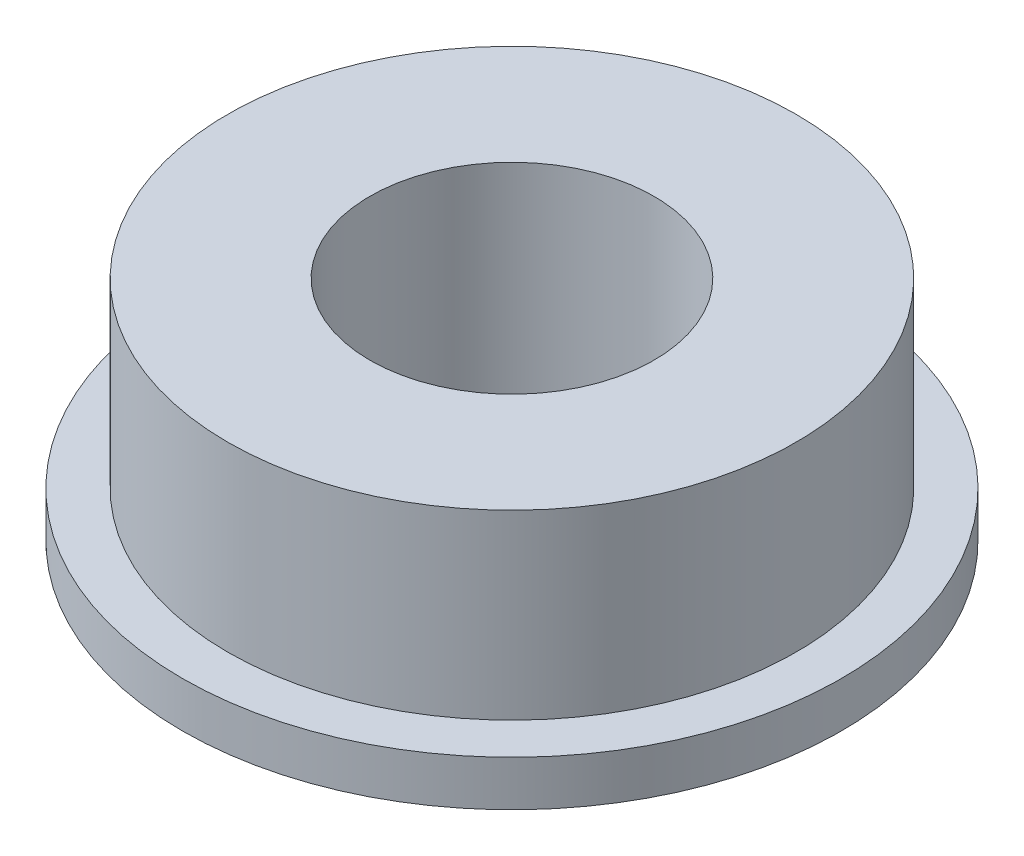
from build123d import *

# Parameters (mm, degrees)
SKETCH_1_R      = 5.8
SKETCH_1_R_2    = 2.5
EXTRUDE_1_DEPTH = 0.8
EXTRUDE_START   = -0.8
SKETCH_2_R      = 5
SKETCH_2_R_2    = 2.5
EXTRUDE_2_DEPTH = 4


with BuildPart() as part:
    # Sketch 1 → Extrude 1 (new body)
    with BuildSketch(Plane(origin=(0, 0, 0), x_dir=(1, 0, 0), z_dir=(0, 1, 0))):
        with Locations(Location((0, 0, 0), (0, 0, 270))):
            Circle(SKETCH_1_R)
        with Locations(Location((0, 0, 0), (0, 0, 270))):
            Circle(SKETCH_1_R_2, mode=Mode.SUBTRACT)
    extrude(amount=EXTRUDE_1_DEPTH)

    # Sketch 2 → Extrude 2 (add)
    with BuildSketch(Plane(origin=(0, 0.8, 0), x_dir=(1, 0, 0), z_dir=(0, 1, 0)).offset(EXTRUDE_START)):
        with Locations(Location((0, 0, 0), (0, 0, 270))):
            Circle(SKETCH_2_R)
        with Locations(Location((0, 0, 0), (0, 0, 270))):
            Circle(SKETCH_2_R_2, mode=Mode.SUBTRACT)
    extrude(amount=EXTRUDE_2_DEPTH)


solid = part.part
